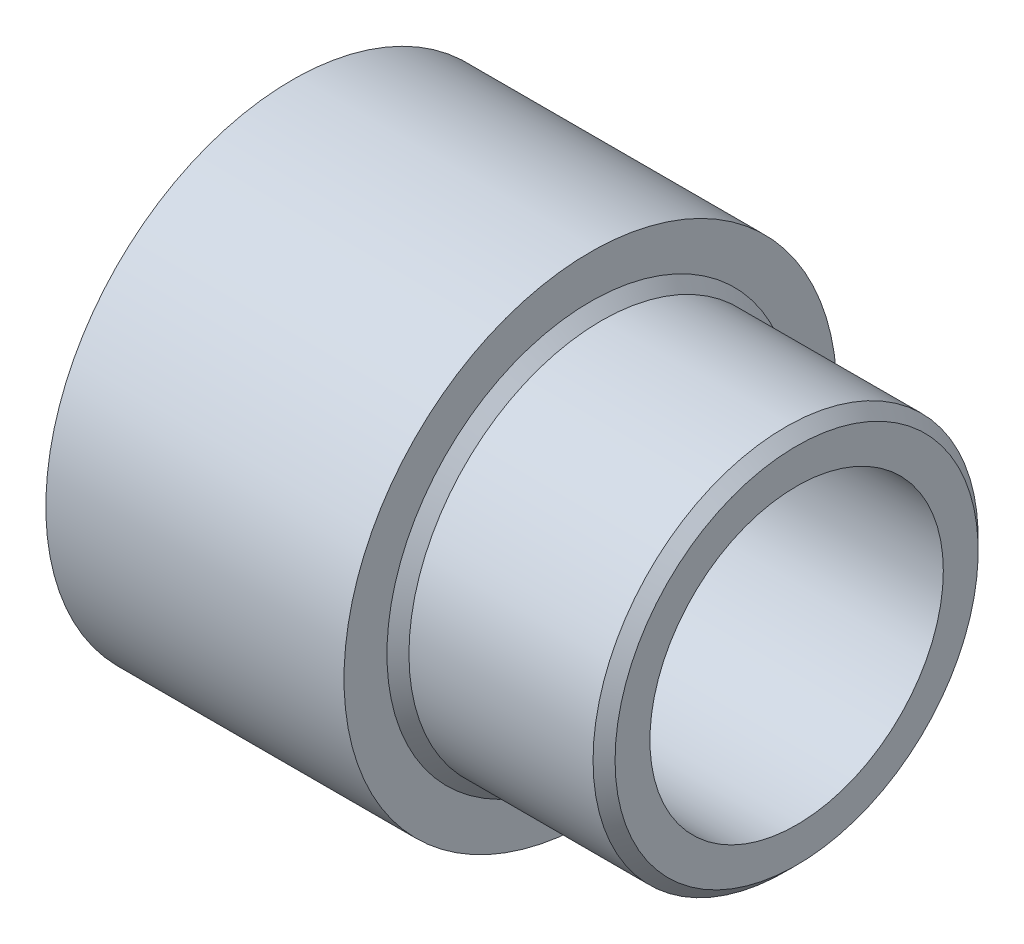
from build123d import *

# Parameters (mm, degrees)
SKETCH1_R                  = 17.0688
OD_EXTRUDE1_DEPTH          = 20.6502
SKETCH4_R                  = 13.335
MALETHD_EXTRUDE2_DEPTH     = 14.2748
CHAMFER1_SIZE              = 0.762
SKETCH6_R                  = 13.5128
SOCKET_CUT_EXTRUDE1_DEPTH  = 19.05
SKETCH7_R                  = 10.16
THRUDIA_CUT_EXTRUDE2_DEPTH = 31.750453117


with BuildPart() as part:
    # Sketch1 → OD-Extrude1 (new body)
    with BuildSketch(Plane(origin=(0, 0, 0), x_dir=(0, 0, -1), z_dir=(1, 0, 0))):
        Circle(SKETCH1_R)
    extrude(amount=OD_EXTRUDE1_DEPTH)

    # Sketch4 → MaleTHD-Extrude2 (add)
    with BuildSketch(Plane.ZY.offset(-20.6502)):
        Circle(SKETCH4_R)
    extrude(amount=-MALETHD_EXTRUDE2_DEPTH)

    # Chamfer1
    chamfer1_edges = [part.edges().sort_by_distance(p)[0] for p in [
        (20.6502, 0, -13.335),
        (34.925, 0, -13.335),
    ]]
    chamfer(chamfer1_edges, length=CHAMFER1_SIZE)

    # Sketch6 → SOCKET-Cut-Extrude1 (cut)
    with BuildSketch(Plane.ZY):
        Circle(SKETCH6_R)
    extrude(amount=-SOCKET_CUT_EXTRUDE1_DEPTH, mode=Mode.SUBTRACT)

    # Sketch7 → ThruDIA-Cut-Extrude2 (cut, through all)
    with BuildSketch(Plane(origin=(19.05, 0, 0), x_dir=(0, 0, -1), z_dir=(1, 0, 0))):
        Circle(SKETCH7_R)
    extrude(amount=THRUDIA_CUT_EXTRUDE2_DEPTH, mode=Mode.SUBTRACT)


solid = part.part
